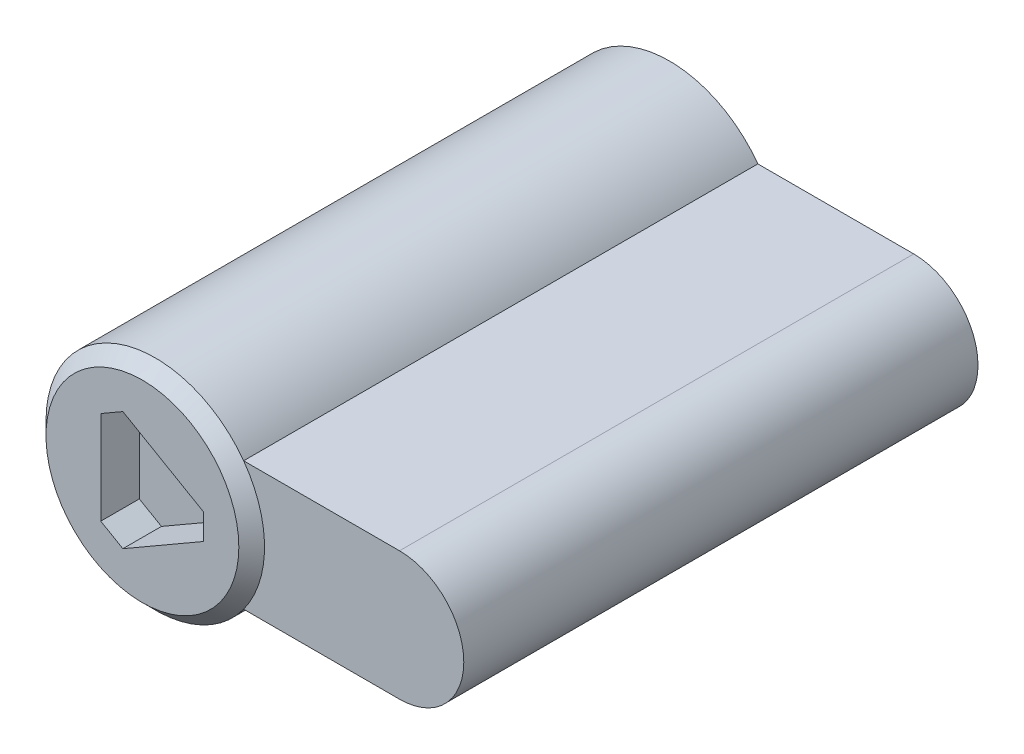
ISO-10303-21;
HEADER;
FILE_DESCRIPTION(('STEP AP214'),'2;1');
FILE_NAME('part.step','',(''),(''),'','','');
FILE_SCHEMA(('AUTOMOTIVE_DESIGN { 1 0 10303 214 1 1 1 1 }'));
ENDSEC;
DATA;
#1=APPLICATION_CONTEXT('core data for automotive mechanical design processes');
#2=APPLICATION_PROTOCOL_DEFINITION('international standard','automotive_design',2000,#1);
#3=PRODUCT_CONTEXT('',#1,'mechanical');
#4=PRODUCT('Part','Part','',(#3));
#5=PRODUCT_RELATED_PRODUCT_CATEGORY('part','',(#4));
#6=PRODUCT_DEFINITION_FORMATION('','',#4);
#7=PRODUCT_DEFINITION_CONTEXT('part definition',#1,'design');
#8=PRODUCT_DEFINITION('design','',#6,#7);
#9=PRODUCT_DEFINITION_SHAPE('','',#8);
#10=(LENGTH_UNIT() NAMED_UNIT(*) SI_UNIT(.MILLI.,.METRE.));
#11=(NAMED_UNIT(*) PLANE_ANGLE_UNIT() SI_UNIT($,.RADIAN.));
#12=(NAMED_UNIT(*) SI_UNIT($,.STERADIAN.) SOLID_ANGLE_UNIT());
#13=UNCERTAINTY_MEASURE_WITH_UNIT(LENGTH_MEASURE(1.E-05),#10,'distance_accuracy_value','');
#14=(GEOMETRIC_REPRESENTATION_CONTEXT(3) GLOBAL_UNCERTAINTY_ASSIGNED_CONTEXT((#13)) GLOBAL_UNIT_ASSIGNED_CONTEXT((#10,
#11,#12)) REPRESENTATION_CONTEXT('',''));
#15=CARTESIAN_POINT('',(0.,0.,0.));
#16=DIRECTION('',(0.,0.,1.));
#17=DIRECTION('',(1.,0.,0.));
#18=AXIS2_PLACEMENT_3D('',#15,#16,#17);
#19=CARTESIAN_POINT('',(0.,0.,-40.));
#20=DIRECTION('',(0.,0.,1.));
#21=DIRECTION('',(0.,1.,0.));
#22=AXIS2_PLACEMENT_3D('',#19,#20,#21);
#23=CYLINDRICAL_SURFACE('',#22,8.5);
#24=DIRECTION('',(0.,0.,1.));
#25=VECTOR('',#24,1.);
#26=CARTESIAN_POINT('',(6.87386354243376,-5.,-40.));
#27=LINE('',#26,#25);
#28=CARTESIAN_POINT('',(6.87386354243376,-5.,-40.));
#29=VERTEX_POINT('',#28);
#30=CARTESIAN_POINT('',(6.87386354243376,-5.,0.));
#31=VERTEX_POINT('',#30);
#32=EDGE_CURVE('E164',#29,#31,#27,.T.);
#33=ORIENTED_EDGE('',*,*,#32,.T.);
#34=CARTESIAN_POINT('',(0.,0.,0.));
#35=DIRECTION('',(0.,0.,1.));
#36=DIRECTION('',(0.,1.,0.));
#37=AXIS2_PLACEMENT_3D('',#34,#35,#36);
#38=CIRCLE('',#37,8.5);
#39=CARTESIAN_POINT('',(6.87386354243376,5.,0.));
#40=VERTEX_POINT('',#39);
#41=EDGE_CURVE('E9',#31,#40,#38,.F.);
#42=ORIENTED_EDGE('',*,*,#41,.T.);
#43=DIRECTION('',(0.,0.,1.));
#44=VECTOR('',#43,1.);
#45=CARTESIAN_POINT('',(6.87386354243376,5.,-40.));
#46=LINE('',#45,#44);
#47=CARTESIAN_POINT('',(6.87386354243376,5.,-40.));
#48=VERTEX_POINT('',#47);
#49=EDGE_CURVE('E36',#48,#40,#46,.T.);
#50=ORIENTED_EDGE('',*,*,#49,.F.);
#51=CARTESIAN_POINT('',(0.,0.,-40.));
#52=DIRECTION('',(0.,0.,1.));
#53=DIRECTION('',(0.,1.,0.));
#54=AXIS2_PLACEMENT_3D('',#51,#52,#53);
#55=CIRCLE('',#54,8.5);
#56=EDGE_CURVE('E153',#48,#29,#55,.T.);
#57=ORIENTED_EDGE('',*,*,#56,.T.);
#58=EDGE_LOOP('',(#33,#42,#50,#57));
#59=FACE_BOUND('',#58,.T.);
#60=ADVANCED_FACE('F14',(#59),#23,.T.);
#61=CARTESIAN_POINT('',(6.87386354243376,5.,-40.));
#62=DIRECTION('',(0.,-1.,0.));
#63=DIRECTION('',(1.,0.,0.));
#64=AXIS2_PLACEMENT_3D('',#61,#62,#63);
#65=PLANE('',#64);
#66=DIRECTION('',(0.,0.,1.));
#67=VECTOR('',#66,1.);
#68=CARTESIAN_POINT('',(19.,5.,-40.));
#69=LINE('',#68,#67);
#70=CARTESIAN_POINT('',(19.,5.,-40.));
#71=VERTEX_POINT('',#70);
#72=CARTESIAN_POINT('',(19.,5.,0.));
#73=VERTEX_POINT('',#72);
#74=EDGE_CURVE('E167',#71,#73,#69,.T.);
#75=ORIENTED_EDGE('',*,*,#74,.F.);
#76=DIRECTION('',(1.,0.,0.));
#77=VECTOR('',#76,1.);
#78=CARTESIAN_POINT('',(6.87386354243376,5.,-40.));
#79=LINE('',#78,#77);
#80=EDGE_CURVE('E161',#48,#71,#79,.T.);
#81=ORIENTED_EDGE('',*,*,#80,.F.);
#82=ORIENTED_EDGE('',*,*,#49,.T.);
#83=DIRECTION('',(1.,0.,0.));
#84=VECTOR('',#83,1.);
#85=CARTESIAN_POINT('',(6.87386354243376,5.,0.));
#86=LINE('',#85,#84);
#87=EDGE_CURVE('E151',#40,#73,#86,.T.);
#88=ORIENTED_EDGE('',*,*,#87,.T.);
#89=EDGE_LOOP('',(#75,#81,#82,#88));
#90=FACE_BOUND('',#89,.T.);
#91=ADVANCED_FACE('F16',(#90),#65,.F.);
#92=CARTESIAN_POINT('',(19.,0.,-40.));
#93=DIRECTION('',(0.,0.,1.));
#94=DIRECTION('',(0.,1.,0.));
#95=AXIS2_PLACEMENT_3D('',#92,#93,#94);
#96=CYLINDRICAL_SURFACE('',#95,5.);
#97=DIRECTION('',(0.,0.,1.));
#98=VECTOR('',#97,1.);
#99=CARTESIAN_POINT('',(19.,-5.,-40.));
#100=LINE('',#99,#98);
#101=CARTESIAN_POINT('',(19.,-5.,-40.));
#102=VERTEX_POINT('',#101);
#103=CARTESIAN_POINT('',(19.,-5.,0.));
#104=VERTEX_POINT('',#103);
#105=EDGE_CURVE('E165',#102,#104,#100,.T.);
#106=ORIENTED_EDGE('',*,*,#105,.F.);
#107=CARTESIAN_POINT('',(19.,0.,-40.));
#108=DIRECTION('',(0.,0.,1.));
#109=DIRECTION('',(0.,1.,0.));
#110=AXIS2_PLACEMENT_3D('',#107,#108,#109);
#111=CIRCLE('',#110,5.);
#112=EDGE_CURVE('E158',#102,#71,#111,.T.);
#113=ORIENTED_EDGE('',*,*,#112,.T.);
#114=ORIENTED_EDGE('',*,*,#74,.T.);
#115=CARTESIAN_POINT('',(19.,0.,0.));
#116=DIRECTION('',(0.,0.,1.));
#117=DIRECTION('',(0.,1.,0.));
#118=AXIS2_PLACEMENT_3D('',#115,#116,#117);
#119=CIRCLE('',#118,5.);
#120=EDGE_CURVE('E148',#104,#73,#119,.T.);
#121=ORIENTED_EDGE('',*,*,#120,.F.);
#122=EDGE_LOOP('',(#106,#113,#114,#121));
#123=FACE_BOUND('',#122,.T.);
#124=ADVANCED_FACE('F200',(#123),#96,.T.);
#125=CARTESIAN_POINT('',(6.87386354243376,-5.,-40.));
#126=DIRECTION('',(0.,-1.,0.));
#127=DIRECTION('',(1.,0.,0.));
#128=AXIS2_PLACEMENT_3D('',#125,#126,#127);
#129=PLANE('',#128);
#130=DIRECTION('',(1.,0.,0.));
#131=VECTOR('',#130,1.);
#132=CARTESIAN_POINT('',(6.87386354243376,-5.,-40.));
#133=LINE('',#132,#131);
#134=EDGE_CURVE('E155',#29,#102,#133,.T.);
#135=ORIENTED_EDGE('',*,*,#134,.T.);
#136=ORIENTED_EDGE('',*,*,#105,.T.);
#137=DIRECTION('',(1.,0.,0.));
#138=VECTOR('',#137,1.);
#139=CARTESIAN_POINT('',(6.87386354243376,-5.,0.));
#140=LINE('',#139,#138);
#141=EDGE_CURVE('E152',#31,#104,#140,.T.);
#142=ORIENTED_EDGE('',*,*,#141,.F.);
#143=ORIENTED_EDGE('',*,*,#32,.F.);
#144=EDGE_LOOP('',(#135,#136,#142,#143));
#145=FACE_BOUND('',#144,.T.);
#146=ADVANCED_FACE('F206',(#145),#129,.T.);
#147=CARTESIAN_POINT('',(0.,0.,-40.));
#148=DIRECTION('',(0.,0.,1.));
#149=DIRECTION('',(0.,1.,0.));
#150=AXIS2_PLACEMENT_3D('',#147,#148,#149);
#151=PLANE('',#150);
#152=ORIENTED_EDGE('',*,*,#56,.F.);
#153=ORIENTED_EDGE('',*,*,#80,.T.);
#154=ORIENTED_EDGE('',*,*,#112,.F.);
#155=ORIENTED_EDGE('',*,*,#134,.F.);
#156=EDGE_LOOP('',(#152,#153,#154,#155));
#157=FACE_BOUND('',#156,.T.);
#158=ADVANCED_FACE('F204',(#157),#151,.F.);
#159=CARTESIAN_POINT('',(0.,0.,0.));
#160=DIRECTION('',(0.,0.,1.));
#161=DIRECTION('',(0.,1.,0.));
#162=AXIS2_PLACEMENT_3D('',#159,#160,#161);
#163=PLANE('',#162);
#164=CARTESIAN_POINT('',(0.,0.,0.));
#165=DIRECTION('',(0.,0.,1.));
#166=DIRECTION('',(0.,1.,0.));
#167=AXIS2_PLACEMENT_3D('',#164,#165,#166);
#168=CIRCLE('',#167,8.5);
#169=EDGE_CURVE('E147',#31,#40,#168,.T.);
#170=ORIENTED_EDGE('',*,*,#169,.F.);
#171=ORIENTED_EDGE('',*,*,#141,.T.);
#172=ORIENTED_EDGE('',*,*,#120,.T.);
#173=ORIENTED_EDGE('',*,*,#87,.F.);
#174=EDGE_LOOP('',(#170,#171,#172,#173));
#175=FACE_BOUND('',#174,.T.);
#176=ADVANCED_FACE('F192',(#175),#163,.T.);
#177=CARTESIAN_POINT('',(0.,0.,1.));
#178=DIRECTION('',(0.,0.,1.));
#179=DIRECTION('',(0.,1.,0.));
#180=AXIS2_PLACEMENT_3D('',#177,#178,#179);
#181=PLANE('',#180);
#182=DIRECTION('',(0.866025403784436,-0.5,0.));
#183=VECTOR('',#182,1.);
#184=CARTESIAN_POINT('',(-3.24,-3.62575969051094,1.));
#185=LINE('',#184,#183);
#186=CARTESIAN_POINT('',(-3.24,-3.62575969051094,1.));
#187=VERTEX_POINT('',#186);
#188=CARTESIAN_POINT('',(-1.52000000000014,-4.61880215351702,1.));
#189=VERTEX_POINT('',#188);
#190=EDGE_CURVE('E29',#187,#189,#185,.T.);
#191=ORIENTED_EDGE('',*,*,#190,.F.);
#192=DIRECTION('',(0.,1.,0.));
#193=VECTOR('',#192,1.);
#194=CARTESIAN_POINT('',(-3.24,-3.62575969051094,1.));
#195=LINE('',#194,#193);
#196=CARTESIAN_POINT('',(-3.24,3.62575969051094,1.));
#197=VERTEX_POINT('',#196);
#198=EDGE_CURVE('E121',#187,#197,#195,.T.);
#199=ORIENTED_EDGE('',*,*,#198,.T.);
#200=DIRECTION('',(0.866025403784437,0.5,0.));
#201=VECTOR('',#200,1.);
#202=CARTESIAN_POINT('',(-3.24,3.62575969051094,1.));
#203=LINE('',#202,#201);
#204=CARTESIAN_POINT('',(-1.52000000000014,4.61880215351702,1.));
#205=VERTEX_POINT('',#204);
#206=EDGE_CURVE('E116',#197,#205,#203,.T.);
#207=ORIENTED_EDGE('',*,*,#206,.T.);
#208=DIRECTION('',(0.866025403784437,-0.5,0.));
#209=VECTOR('',#208,1.);
#210=CARTESIAN_POINT('',(-1.52000000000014,4.61880215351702,1.));
#211=LINE('',#210,#209);
#212=CARTESIAN_POINT('',(4.76,0.993042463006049,1.));
#213=VERTEX_POINT('',#212);
#214=EDGE_CURVE('E114',#205,#213,#211,.T.);
#215=ORIENTED_EDGE('',*,*,#214,.T.);
#216=DIRECTION('',(0.,1.,0.));
#217=VECTOR('',#216,1.);
#218=CARTESIAN_POINT('',(4.76,-0.993042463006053,1.));
#219=LINE('',#218,#217);
#220=CARTESIAN_POINT('',(4.76,-0.993042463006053,1.));
#221=VERTEX_POINT('',#220);
#222=EDGE_CURVE('E95',#221,#213,#219,.T.);
#223=ORIENTED_EDGE('',*,*,#222,.F.);
#224=DIRECTION('',(0.866025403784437,0.5,0.));
#225=VECTOR('',#224,1.);
#226=CARTESIAN_POINT('',(-1.52000000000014,-4.61880215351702,1.));
#227=LINE('',#226,#225);
#228=EDGE_CURVE('E106',#189,#221,#227,.T.);
#229=ORIENTED_EDGE('',*,*,#228,.F.);
#230=EDGE_LOOP('',(#191,#199,#207,#215,#223,#229));
#231=FACE_BOUND('',#230,.T.);
#232=CARTESIAN_POINT('',(0.,0.,1.));
#233=DIRECTION('',(0.,0.,1.));
#234=DIRECTION('',(0.,1.,0.));
#235=AXIS2_PLACEMENT_3D('',#232,#233,#234);
#236=CIRCLE('',#235,7.5);
#237=CARTESIAN_POINT('',(0.,7.5,1.));
#238=VERTEX_POINT('',#237);
#239=EDGE_CURVE('E22',#238,#238,#236,.T.);
#240=ORIENTED_EDGE('',*,*,#239,.T.);
#241=EDGE_LOOP('',(#240));
#242=FACE_BOUND('',#241,.T.);
#243=ADVANCED_FACE('F110',(#231,#242),#181,.T.);
#244=CARTESIAN_POINT('',(0.,0.,1.));
#245=DIRECTION('',(0.,0.,-1.));
#246=DIRECTION('',(0.,-1.,0.));
#247=AXIS2_PLACEMENT_3D('',#244,#245,#246);
#248=CONICAL_SURFACE('',#247,7.5,0.785398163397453);
#249=ORIENTED_EDGE('',*,*,#41,.F.);
#250=ORIENTED_EDGE('',*,*,#169,.T.);
#251=EDGE_LOOP('',(#249,#250));
#252=FACE_BOUND('',#251,.T.);
#253=ORIENTED_EDGE('',*,*,#239,.F.);
#254=EDGE_LOOP('',(#253));
#255=FACE_BOUND('',#254,.T.);
#256=ADVANCED_FACE('F180',(#252,#255),#248,.T.);
#257=CARTESIAN_POINT('',(-3.24,-3.62575969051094,-2.));
#258=DIRECTION('',(-0.5,-0.866025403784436,0.));
#259=DIRECTION('',(0.866025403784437,-0.5,0.));
#260=AXIS2_PLACEMENT_3D('',#257,#258,#259);
#261=PLANE('',#260);
#262=DIRECTION('',(0.,0.,1.));
#263=VECTOR('',#262,1.);
#264=CARTESIAN_POINT('',(-3.24,-3.62575969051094,-2.));
#265=LINE('',#264,#263);
#266=CARTESIAN_POINT('',(-3.24,-3.62575969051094,-2.));
#267=VERTEX_POINT('',#266);
#268=EDGE_CURVE('E145',#267,#187,#265,.T.);
#269=ORIENTED_EDGE('',*,*,#268,.T.);
#270=ORIENTED_EDGE('',*,*,#190,.T.);
#271=DIRECTION('',(0.,0.,1.));
#272=VECTOR('',#271,1.);
#273=CARTESIAN_POINT('',(-1.52000000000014,-4.61880215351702,-2.));
#274=LINE('',#273,#272);
#275=CARTESIAN_POINT('',(-1.52000000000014,-4.61880215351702,-2.));
#276=VERTEX_POINT('',#275);
#277=EDGE_CURVE('E103',#276,#189,#274,.T.);
#278=ORIENTED_EDGE('',*,*,#277,.F.);
#279=DIRECTION('',(0.866025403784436,-0.5,0.));
#280=VECTOR('',#279,1.);
#281=CARTESIAN_POINT('',(-3.24,-3.62575969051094,-2.));
#282=LINE('',#281,#280);
#283=EDGE_CURVE('E124',#267,#276,#282,.T.);
#284=ORIENTED_EDGE('',*,*,#283,.F.);
#285=EDGE_LOOP('',(#269,#270,#278,#284));
#286=FACE_BOUND('',#285,.T.);
#287=ADVANCED_FACE('F182',(#286),#261,.F.);
#288=CARTESIAN_POINT('',(-3.24,-3.62575969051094,-2.));
#289=DIRECTION('',(1.,0.,0.));
#290=DIRECTION('',(0.,1.,0.));
#291=AXIS2_PLACEMENT_3D('',#288,#289,#290);
#292=PLANE('',#291);
#293=DIRECTION('',(0.,0.,1.));
#294=VECTOR('',#293,1.);
#295=CARTESIAN_POINT('',(-3.24,3.62575969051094,-2.));
#296=LINE('',#295,#294);
#297=CARTESIAN_POINT('',(-3.24,3.62575969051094,-2.));
#298=VERTEX_POINT('',#297);
#299=EDGE_CURVE('E143',#298,#197,#296,.T.);
#300=ORIENTED_EDGE('',*,*,#299,.T.);
#301=ORIENTED_EDGE('',*,*,#198,.F.);
#302=ORIENTED_EDGE('',*,*,#268,.F.);
#303=DIRECTION('',(0.,1.,0.));
#304=VECTOR('',#303,1.);
#305=CARTESIAN_POINT('',(-3.24,-3.62575969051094,-2.));
#306=LINE('',#305,#304);
#307=EDGE_CURVE('E136',#267,#298,#306,.T.);
#308=ORIENTED_EDGE('',*,*,#307,.T.);
#309=EDGE_LOOP('',(#300,#301,#302,#308));
#310=FACE_BOUND('',#309,.T.);
#311=ADVANCED_FACE('F190',(#310),#292,.T.);
#312=CARTESIAN_POINT('',(-3.24,3.62575969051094,-2.));
#313=DIRECTION('',(0.5,-0.866025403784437,0.));
#314=DIRECTION('',(0.866025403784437,0.5,0.));
#315=AXIS2_PLACEMENT_3D('',#312,#313,#314);
#316=PLANE('',#315);
#317=DIRECTION('',(0.,0.,1.));
#318=VECTOR('',#317,1.);
#319=CARTESIAN_POINT('',(-1.52000000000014,4.61880215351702,-2.));
#320=LINE('',#319,#318);
#321=CARTESIAN_POINT('',(-1.52000000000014,4.61880215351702,-2.));
#322=VERTEX_POINT('',#321);
#323=EDGE_CURVE('E141',#322,#205,#320,.T.);
#324=ORIENTED_EDGE('',*,*,#323,.T.);
#325=ORIENTED_EDGE('',*,*,#206,.F.);
#326=ORIENTED_EDGE('',*,*,#299,.F.);
#327=DIRECTION('',(0.866025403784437,0.5,0.));
#328=VECTOR('',#327,1.);
#329=CARTESIAN_POINT('',(-3.24,3.62575969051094,-2.));
#330=LINE('',#329,#328);
#331=EDGE_CURVE('E133',#298,#322,#330,.T.);
#332=ORIENTED_EDGE('',*,*,#331,.T.);
#333=EDGE_LOOP('',(#324,#325,#326,#332));
#334=FACE_BOUND('',#333,.T.);
#335=ADVANCED_FACE('F259',(#334),#316,.T.);
#336=CARTESIAN_POINT('',(-1.52000000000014,4.61880215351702,-2.));
#337=DIRECTION('',(-0.5,-0.866025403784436,0.));
#338=DIRECTION('',(0.866025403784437,-0.5,0.));
#339=AXIS2_PLACEMENT_3D('',#336,#337,#338);
#340=PLANE('',#339);
#341=DIRECTION('',(0.,0.,1.));
#342=VECTOR('',#341,1.);
#343=CARTESIAN_POINT('',(4.76,0.993042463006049,-2.));
#344=LINE('',#343,#342);
#345=CARTESIAN_POINT('',(4.76,0.993042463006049,-2.));
#346=VERTEX_POINT('',#345);
#347=EDGE_CURVE('E102',#346,#213,#344,.T.);
#348=ORIENTED_EDGE('',*,*,#347,.T.);
#349=ORIENTED_EDGE('',*,*,#214,.F.);
#350=ORIENTED_EDGE('',*,*,#323,.F.);
#351=DIRECTION('',(0.866025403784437,-0.5,0.));
#352=VECTOR('',#351,1.);
#353=CARTESIAN_POINT('',(-1.52000000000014,4.61880215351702,-2.));
#354=LINE('',#353,#352);
#355=EDGE_CURVE('E130',#322,#346,#354,.T.);
#356=ORIENTED_EDGE('',*,*,#355,.T.);
#357=EDGE_LOOP('',(#348,#349,#350,#356));
#358=FACE_BOUND('',#357,.T.);
#359=ADVANCED_FACE('F268',(#358),#340,.T.);
#360=CARTESIAN_POINT('',(4.76,-0.993042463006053,-2.));
#361=DIRECTION('',(1.,0.,0.));
#362=DIRECTION('',(0.,1.,0.));
#363=AXIS2_PLACEMENT_3D('',#360,#361,#362);
#364=PLANE('',#363);
#365=DIRECTION('',(0.,0.,1.));
#366=VECTOR('',#365,1.);
#367=CARTESIAN_POINT('',(4.76,-0.993042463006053,-2.));
#368=LINE('',#367,#366);
#369=CARTESIAN_POINT('',(4.76,-0.993042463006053,-2.));
#370=VERTEX_POINT('',#369);
#371=EDGE_CURVE('E91',#370,#221,#368,.T.);
#372=ORIENTED_EDGE('',*,*,#371,.T.);
#373=ORIENTED_EDGE('',*,*,#222,.T.);
#374=ORIENTED_EDGE('',*,*,#347,.F.);
#375=DIRECTION('',(0.,1.,0.));
#376=VECTOR('',#375,1.);
#377=CARTESIAN_POINT('',(4.76,-0.993042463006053,-2.));
#378=LINE('',#377,#376);
#379=EDGE_CURVE('E98',#370,#346,#378,.T.);
#380=ORIENTED_EDGE('',*,*,#379,.F.);
#381=EDGE_LOOP('',(#372,#373,#374,#380));
#382=FACE_BOUND('',#381,.T.);
#383=ADVANCED_FACE('F93',(#382),#364,.F.);
#384=CARTESIAN_POINT('',(-1.52000000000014,-4.61880215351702,-2.));
#385=DIRECTION('',(0.5,-0.866025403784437,0.));
#386=DIRECTION('',(0.866025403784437,0.5,0.));
#387=AXIS2_PLACEMENT_3D('',#384,#385,#386);
#388=PLANE('',#387);
#389=DIRECTION('',(0.866025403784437,0.5,0.));
#390=VECTOR('',#389,1.);
#391=CARTESIAN_POINT('',(-1.52000000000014,-4.61880215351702,-2.));
#392=LINE('',#391,#390);
#393=EDGE_CURVE('E127',#276,#370,#392,.T.);
#394=ORIENTED_EDGE('',*,*,#393,.F.);
#395=ORIENTED_EDGE('',*,*,#277,.T.);
#396=ORIENTED_EDGE('',*,*,#228,.T.);
#397=ORIENTED_EDGE('',*,*,#371,.F.);
#398=EDGE_LOOP('',(#394,#395,#396,#397));
#399=FACE_BOUND('',#398,.T.);
#400=ADVANCED_FACE('F107',(#399),#388,.F.);
#401=CARTESIAN_POINT('',(-1.52000000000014,-4.61880215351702,-2.));
#402=DIRECTION('',(0.,0.,1.));
#403=DIRECTION('',(0.,1.,0.));
#404=AXIS2_PLACEMENT_3D('',#401,#402,#403);
#405=PLANE('',#404);
#406=ORIENTED_EDGE('',*,*,#283,.T.);
#407=ORIENTED_EDGE('',*,*,#393,.T.);
#408=ORIENTED_EDGE('',*,*,#379,.T.);
#409=ORIENTED_EDGE('',*,*,#355,.F.);
#410=ORIENTED_EDGE('',*,*,#331,.F.);
#411=ORIENTED_EDGE('',*,*,#307,.F.);
#412=EDGE_LOOP('',(#406,#407,#408,#409,#410,#411));
#413=FACE_BOUND('',#412,.T.);
#414=ADVANCED_FACE('F288',(#413),#405,.T.);
#415=CLOSED_SHELL('',(#60,#91,#124,#146,#158,#176,#243,#256,#287,#311,#335,#359,#383,#400,#414));
#416=MANIFOLD_SOLID_BREP('B1',#415);
#417=ADVANCED_BREP_SHAPE_REPRESENTATION('',(#18,#416),#14);
#418=SHAPE_DEFINITION_REPRESENTATION(#9,#417);
ENDSEC;
END-ISO-10303-21;
